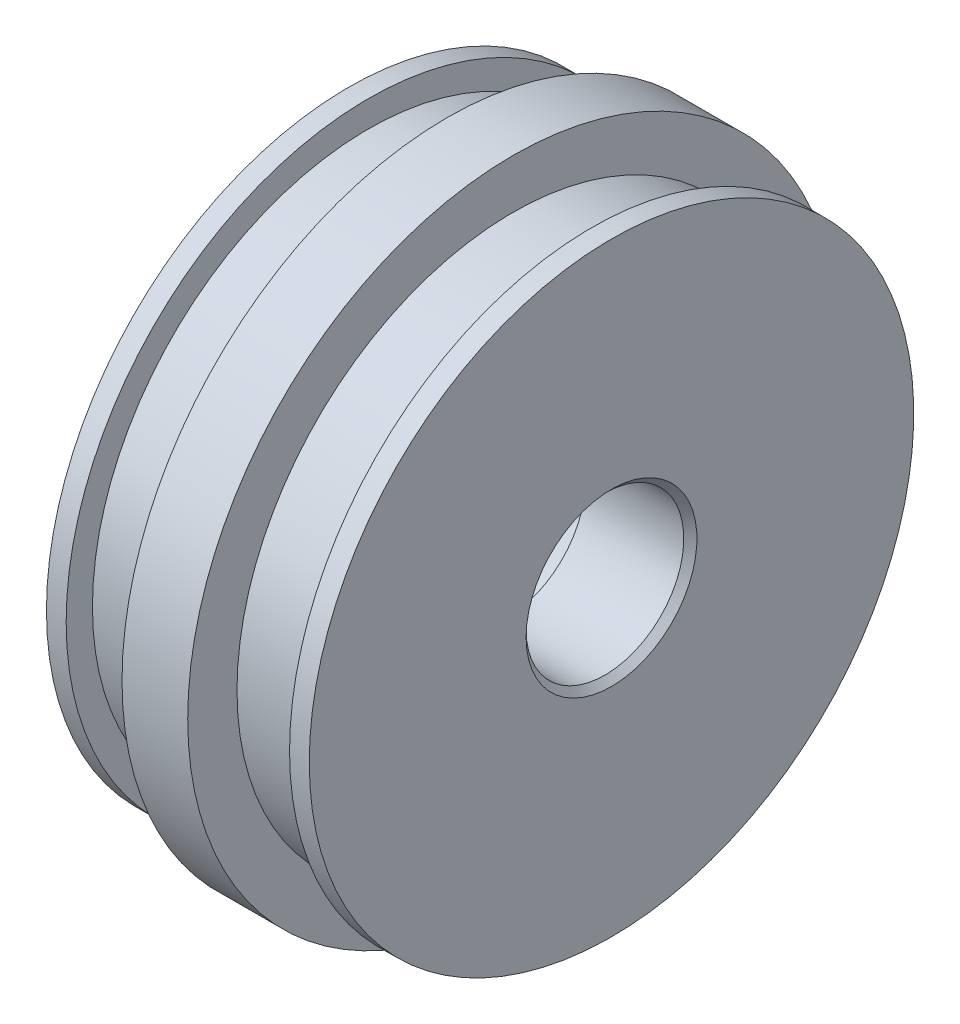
ISO-10303-21;
HEADER;
FILE_DESCRIPTION(('STEP AP214'),'2;1');
FILE_NAME('part.step','',(''),(''),'','','');
FILE_SCHEMA(('AUTOMOTIVE_DESIGN { 1 0 10303 214 1 1 1 1 }'));
ENDSEC;
DATA;
#1=APPLICATION_CONTEXT('core data for automotive mechanical design processes');
#2=APPLICATION_PROTOCOL_DEFINITION('international standard','automotive_design',2000,#1);
#3=PRODUCT_CONTEXT('',#1,'mechanical');
#4=PRODUCT('Part','Part','',(#3));
#5=PRODUCT_RELATED_PRODUCT_CATEGORY('part','',(#4));
#6=PRODUCT_DEFINITION_FORMATION('','',#4);
#7=PRODUCT_DEFINITION_CONTEXT('part definition',#1,'design');
#8=PRODUCT_DEFINITION('design','',#6,#7);
#9=PRODUCT_DEFINITION_SHAPE('','',#8);
#10=(LENGTH_UNIT() NAMED_UNIT(*) SI_UNIT(.MILLI.,.METRE.));
#11=(NAMED_UNIT(*) PLANE_ANGLE_UNIT() SI_UNIT($,.RADIAN.));
#12=(NAMED_UNIT(*) SI_UNIT($,.STERADIAN.) SOLID_ANGLE_UNIT());
#13=UNCERTAINTY_MEASURE_WITH_UNIT(LENGTH_MEASURE(1.E-05),#10,'distance_accuracy_value','');
#14=(GEOMETRIC_REPRESENTATION_CONTEXT(3) GLOBAL_UNCERTAINTY_ASSIGNED_CONTEXT((#13)) GLOBAL_UNIT_ASSIGNED_CONTEXT((#10,
#11,#12)) REPRESENTATION_CONTEXT('',''));
#15=CARTESIAN_POINT('',(0.,0.,0.));
#16=DIRECTION('',(0.,0.,1.));
#17=DIRECTION('',(1.,0.,0.));
#18=AXIS2_PLACEMENT_3D('',#15,#16,#17);
#19=CARTESIAN_POINT('',(0.,0.,0.));
#20=DIRECTION('',(-1.,0.,0.));
#21=DIRECTION('',(0.,0.,1.));
#22=AXIS2_PLACEMENT_3D('',#19,#20,#21);
#23=CYLINDRICAL_SURFACE('',#22,6.);
#24=CARTESIAN_POINT('',(19.5,0.,0.));
#25=DIRECTION('',(-1.,0.,0.));
#26=DIRECTION('',(0.,0.,1.));
#27=AXIS2_PLACEMENT_3D('',#24,#25,#26);
#28=CIRCLE('',#27,6.);
#29=CARTESIAN_POINT('',(19.5,0.,6.));
#30=VERTEX_POINT('',#29);
#31=EDGE_CURVE('E11',#30,#30,#28,.F.);
#32=ORIENTED_EDGE('',*,*,#31,.T.);
#33=EDGE_LOOP('',(#32));
#34=FACE_BOUND('',#33,.T.);
#35=CARTESIAN_POINT('',(12.,0.,0.));
#36=DIRECTION('',(-1.,0.,0.));
#37=DIRECTION('',(0.,0.,1.));
#38=AXIS2_PLACEMENT_3D('',#35,#36,#37);
#39=CIRCLE('',#38,6.);
#40=CARTESIAN_POINT('',(12.,0.,6.));
#41=VERTEX_POINT('',#40);
#42=EDGE_CURVE('E55',#41,#41,#39,.F.);
#43=ORIENTED_EDGE('',*,*,#42,.F.);
#44=EDGE_LOOP('',(#43));
#45=FACE_BOUND('',#44,.T.);
#46=ADVANCED_FACE('F37',(#34,#45),#23,.F.);
#47=CARTESIAN_POINT('',(0.,0.,0.));
#48=DIRECTION('',(-1.,0.,0.));
#49=DIRECTION('',(0.,0.,1.));
#50=AXIS2_PLACEMENT_3D('',#47,#48,#49);
#51=CYLINDRICAL_SURFACE('',#50,23.);
#52=CARTESIAN_POINT('',(0.,0.,0.));
#53=DIRECTION('',(-1.,0.,0.));
#54=DIRECTION('',(0.,0.,1.));
#55=AXIS2_PLACEMENT_3D('',#52,#53,#54);
#56=CIRCLE('',#55,23.);
#57=CARTESIAN_POINT('',(0.,0.,23.));
#58=VERTEX_POINT('',#57);
#59=EDGE_CURVE('E48',#58,#58,#56,.T.);
#60=ORIENTED_EDGE('',*,*,#59,.F.);
#61=EDGE_LOOP('',(#60));
#62=FACE_BOUND('',#61,.T.);
#63=CARTESIAN_POINT('',(1.5,0.,0.));
#64=DIRECTION('',(-1.,0.,0.));
#65=DIRECTION('',(0.,0.,1.));
#66=AXIS2_PLACEMENT_3D('',#63,#64,#65);
#67=CIRCLE('',#66,23.);
#68=CARTESIAN_POINT('',(1.5,0.,23.));
#69=VERTEX_POINT('',#68);
#70=EDGE_CURVE('E57',#69,#69,#67,.T.);
#71=ORIENTED_EDGE('',*,*,#70,.T.);
#72=EDGE_LOOP('',(#71));
#73=FACE_BOUND('',#72,.T.);
#74=ADVANCED_FACE('F39',(#62,#73),#51,.T.);
#75=CARTESIAN_POINT('',(0.,23.,0.));
#76=DIRECTION('',(1.,0.,0.));
#77=DIRECTION('',(0.,0.,-1.));
#78=AXIS2_PLACEMENT_3D('',#75,#76,#77);
#79=PLANE('',#78);
#80=CARTESIAN_POINT('',(0.,0.,0.));
#81=DIRECTION('',(-1.,0.,0.));
#82=DIRECTION('',(0.,0.,1.));
#83=AXIS2_PLACEMENT_3D('',#80,#81,#82);
#84=CIRCLE('',#83,16.);
#85=CARTESIAN_POINT('',(0.,0.,16.));
#86=VERTEX_POINT('',#85);
#87=EDGE_CURVE('E88',#86,#86,#84,.T.);
#88=ORIENTED_EDGE('',*,*,#87,.F.);
#89=EDGE_LOOP('',(#88));
#90=FACE_BOUND('',#89,.T.);
#91=ORIENTED_EDGE('',*,*,#59,.T.);
#92=EDGE_LOOP('',(#91));
#93=FACE_BOUND('',#92,.T.);
#94=ADVANCED_FACE('F94',(#90,#93),#79,.F.);
#95=CARTESIAN_POINT('',(20.,6.,0.));
#96=DIRECTION('',(-1.,0.,0.));
#97=DIRECTION('',(0.,0.,1.));
#98=AXIS2_PLACEMENT_3D('',#95,#96,#97);
#99=PLANE('',#98);
#100=CARTESIAN_POINT('',(20.,0.,0.));
#101=DIRECTION('',(-1.,0.,0.));
#102=DIRECTION('',(0.,0.,1.));
#103=AXIS2_PLACEMENT_3D('',#100,#101,#102);
#104=CIRCLE('',#103,6.5);
#105=CARTESIAN_POINT('',(20.,0.,6.5));
#106=VERTEX_POINT('',#105);
#107=EDGE_CURVE('E44',#106,#106,#104,.T.);
#108=ORIENTED_EDGE('',*,*,#107,.T.);
#109=EDGE_LOOP('',(#108));
#110=FACE_BOUND('',#109,.T.);
#111=CARTESIAN_POINT('',(20.,0.,0.));
#112=DIRECTION('',(-1.,0.,0.));
#113=DIRECTION('',(0.,0.,1.));
#114=AXIS2_PLACEMENT_3D('',#111,#112,#113);
#115=CIRCLE('',#114,23.);
#116=CARTESIAN_POINT('',(20.,0.,23.));
#117=VERTEX_POINT('',#116);
#118=EDGE_CURVE('E52',#117,#117,#115,.T.);
#119=ORIENTED_EDGE('',*,*,#118,.F.);
#120=EDGE_LOOP('',(#119));
#121=FACE_BOUND('',#120,.T.);
#122=ADVANCED_FACE('F97',(#110,#121),#99,.F.);
#123=CARTESIAN_POINT('',(0.,0.,0.));
#124=DIRECTION('',(-1.,0.,0.));
#125=DIRECTION('',(0.,0.,1.));
#126=AXIS2_PLACEMENT_3D('',#123,#124,#125);
#127=CYLINDRICAL_SURFACE('',#126,23.);
#128=CARTESIAN_POINT('',(18.5,0.,0.));
#129=DIRECTION('',(-1.,0.,0.));
#130=DIRECTION('',(0.,0.,1.));
#131=AXIS2_PLACEMENT_3D('',#128,#129,#130);
#132=CIRCLE('',#131,23.);
#133=CARTESIAN_POINT('',(18.5,0.,23.));
#134=VERTEX_POINT('',#133);
#135=EDGE_CURVE('E62',#134,#134,#132,.T.);
#136=ORIENTED_EDGE('',*,*,#135,.F.);
#137=EDGE_LOOP('',(#136));
#138=FACE_BOUND('',#137,.T.);
#139=ORIENTED_EDGE('',*,*,#118,.T.);
#140=EDGE_LOOP('',(#139));
#141=FACE_BOUND('',#140,.T.);
#142=ADVANCED_FACE('F144',(#138,#141),#127,.T.);
#143=CARTESIAN_POINT('',(18.5,23.,0.));
#144=DIRECTION('',(1.,0.,0.));
#145=DIRECTION('',(0.,0.,-1.));
#146=AXIS2_PLACEMENT_3D('',#143,#144,#145);
#147=PLANE('',#146);
#148=CARTESIAN_POINT('',(18.5,0.,0.));
#149=DIRECTION('',(-1.,0.,0.));
#150=DIRECTION('',(0.,0.,1.));
#151=AXIS2_PLACEMENT_3D('',#148,#149,#150);
#152=CIRCLE('',#151,21.);
#153=CARTESIAN_POINT('',(18.5,0.,21.));
#154=VERTEX_POINT('',#153);
#155=EDGE_CURVE('E65',#154,#154,#152,.T.);
#156=ORIENTED_EDGE('',*,*,#155,.F.);
#157=EDGE_LOOP('',(#156));
#158=FACE_BOUND('',#157,.T.);
#159=ORIENTED_EDGE('',*,*,#135,.T.);
#160=EDGE_LOOP('',(#159));
#161=FACE_BOUND('',#160,.T.);
#162=ADVANCED_FACE('F138',(#158,#161),#147,.F.);
#163=CARTESIAN_POINT('',(0.,0.,0.));
#164=DIRECTION('',(-1.,0.,0.));
#165=DIRECTION('',(0.,0.,1.));
#166=AXIS2_PLACEMENT_3D('',#163,#164,#165);
#167=CYLINDRICAL_SURFACE('',#166,21.);
#168=CARTESIAN_POINT('',(12.5,0.,0.));
#169=DIRECTION('',(-1.,0.,0.));
#170=DIRECTION('',(0.,0.,1.));
#171=AXIS2_PLACEMENT_3D('',#168,#169,#170);
#172=CIRCLE('',#171,21.);
#173=CARTESIAN_POINT('',(12.5,0.,21.));
#174=VERTEX_POINT('',#173);
#175=EDGE_CURVE('E68',#174,#174,#172,.T.);
#176=ORIENTED_EDGE('',*,*,#175,.F.);
#177=EDGE_LOOP('',(#176));
#178=FACE_BOUND('',#177,.T.);
#179=ORIENTED_EDGE('',*,*,#155,.T.);
#180=EDGE_LOOP('',(#179));
#181=FACE_BOUND('',#180,.T.);
#182=ADVANCED_FACE('F132',(#178,#181),#167,.T.);
#183=CARTESIAN_POINT('',(12.5,21.,0.));
#184=DIRECTION('',(-1.,0.,0.));
#185=DIRECTION('',(0.,0.,1.));
#186=AXIS2_PLACEMENT_3D('',#183,#184,#185);
#187=PLANE('',#186);
#188=CARTESIAN_POINT('',(12.5,0.,0.));
#189=DIRECTION('',(-1.,0.,0.));
#190=DIRECTION('',(0.,0.,1.));
#191=AXIS2_PLACEMENT_3D('',#188,#189,#190);
#192=CIRCLE('',#191,24.75);
#193=CARTESIAN_POINT('',(12.5,0.,24.75));
#194=VERTEX_POINT('',#193);
#195=EDGE_CURVE('E71',#194,#194,#192,.T.);
#196=ORIENTED_EDGE('',*,*,#195,.F.);
#197=EDGE_LOOP('',(#196));
#198=FACE_BOUND('',#197,.T.);
#199=ORIENTED_EDGE('',*,*,#175,.T.);
#200=EDGE_LOOP('',(#199));
#201=FACE_BOUND('',#200,.T.);
#202=ADVANCED_FACE('F126',(#198,#201),#187,.F.);
#203=CARTESIAN_POINT('',(0.,0.,0.));
#204=DIRECTION('',(-1.,0.,0.));
#205=DIRECTION('',(0.,0.,1.));
#206=AXIS2_PLACEMENT_3D('',#203,#204,#205);
#207=CYLINDRICAL_SURFACE('',#206,24.75);
#208=CARTESIAN_POINT('',(7.5,0.,0.));
#209=DIRECTION('',(-1.,0.,0.));
#210=DIRECTION('',(0.,0.,1.));
#211=AXIS2_PLACEMENT_3D('',#208,#209,#210);
#212=CIRCLE('',#211,24.75);
#213=CARTESIAN_POINT('',(7.5,0.,24.75));
#214=VERTEX_POINT('',#213);
#215=EDGE_CURVE('E74',#214,#214,#212,.T.);
#216=ORIENTED_EDGE('',*,*,#215,.F.);
#217=EDGE_LOOP('',(#216));
#218=FACE_BOUND('',#217,.T.);
#219=ORIENTED_EDGE('',*,*,#195,.T.);
#220=EDGE_LOOP('',(#219));
#221=FACE_BOUND('',#220,.T.);
#222=ADVANCED_FACE('F120',(#218,#221),#207,.T.);
#223=CARTESIAN_POINT('',(7.5,24.75,0.));
#224=DIRECTION('',(1.,0.,0.));
#225=DIRECTION('',(0.,0.,-1.));
#226=AXIS2_PLACEMENT_3D('',#223,#224,#225);
#227=PLANE('',#226);
#228=CARTESIAN_POINT('',(7.5,0.,0.));
#229=DIRECTION('',(-1.,0.,0.));
#230=DIRECTION('',(0.,0.,1.));
#231=AXIS2_PLACEMENT_3D('',#228,#229,#230);
#232=CIRCLE('',#231,21.);
#233=CARTESIAN_POINT('',(7.5,0.,21.));
#234=VERTEX_POINT('',#233);
#235=EDGE_CURVE('E77',#234,#234,#232,.T.);
#236=ORIENTED_EDGE('',*,*,#235,.F.);
#237=EDGE_LOOP('',(#236));
#238=FACE_BOUND('',#237,.T.);
#239=ORIENTED_EDGE('',*,*,#215,.T.);
#240=EDGE_LOOP('',(#239));
#241=FACE_BOUND('',#240,.T.);
#242=ADVANCED_FACE('F114',(#238,#241),#227,.F.);
#243=CARTESIAN_POINT('',(0.,0.,0.));
#244=DIRECTION('',(-1.,0.,0.));
#245=DIRECTION('',(0.,0.,1.));
#246=AXIS2_PLACEMENT_3D('',#243,#244,#245);
#247=CYLINDRICAL_SURFACE('',#246,21.);
#248=CARTESIAN_POINT('',(1.5,0.,0.));
#249=DIRECTION('',(-1.,0.,0.));
#250=DIRECTION('',(0.,0.,1.));
#251=AXIS2_PLACEMENT_3D('',#248,#249,#250);
#252=CIRCLE('',#251,21.);
#253=CARTESIAN_POINT('',(1.5,0.,21.));
#254=VERTEX_POINT('',#253);
#255=EDGE_CURVE('E80',#254,#254,#252,.T.);
#256=ORIENTED_EDGE('',*,*,#255,.F.);
#257=EDGE_LOOP('',(#256));
#258=FACE_BOUND('',#257,.T.);
#259=ORIENTED_EDGE('',*,*,#235,.T.);
#260=EDGE_LOOP('',(#259));
#261=FACE_BOUND('',#260,.T.);
#262=ADVANCED_FACE('F108',(#258,#261),#247,.T.);
#263=CARTESIAN_POINT('',(1.5,21.,0.));
#264=DIRECTION('',(-1.,0.,0.));
#265=DIRECTION('',(0.,0.,1.));
#266=AXIS2_PLACEMENT_3D('',#263,#264,#265);
#267=PLANE('',#266);
#268=ORIENTED_EDGE('',*,*,#70,.F.);
#269=EDGE_LOOP('',(#268));
#270=FACE_BOUND('',#269,.T.);
#271=ORIENTED_EDGE('',*,*,#255,.T.);
#272=EDGE_LOOP('',(#271));
#273=FACE_BOUND('',#272,.T.);
#274=ADVANCED_FACE('F104',(#270,#273),#267,.F.);
#275=CARTESIAN_POINT('',(12.,0.,0.));
#276=DIRECTION('',(-1.,0.,0.));
#277=DIRECTION('',(0.,0.,1.));
#278=AXIS2_PLACEMENT_3D('',#275,#276,#277);
#279=PLANE('',#278);
#280=CARTESIAN_POINT('',(12.,0.,0.));
#281=DIRECTION('',(-1.,0.,0.));
#282=DIRECTION('',(0.,0.,1.));
#283=AXIS2_PLACEMENT_3D('',#280,#281,#282);
#284=CIRCLE('',#283,16.);
#285=CARTESIAN_POINT('',(12.,0.,16.));
#286=VERTEX_POINT('',#285);
#287=EDGE_CURVE('E58',#286,#286,#284,.T.);
#288=ORIENTED_EDGE('',*,*,#287,.T.);
#289=EDGE_LOOP('',(#288));
#290=FACE_BOUND('',#289,.T.);
#291=ORIENTED_EDGE('',*,*,#42,.T.);
#292=EDGE_LOOP('',(#291));
#293=FACE_BOUND('',#292,.T.);
#294=ADVANCED_FACE('F107',(#290,#293),#279,.T.);
#295=CARTESIAN_POINT('',(12.,0.,0.));
#296=DIRECTION('',(-1.,0.,0.));
#297=DIRECTION('',(0.,0.,1.));
#298=AXIS2_PLACEMENT_3D('',#295,#296,#297);
#299=CYLINDRICAL_SURFACE('',#298,16.);
#300=ORIENTED_EDGE('',*,*,#287,.F.);
#301=EDGE_LOOP('',(#300));
#302=FACE_BOUND('',#301,.T.);
#303=ORIENTED_EDGE('',*,*,#87,.T.);
#304=EDGE_LOOP('',(#303));
#305=FACE_BOUND('',#304,.T.);
#306=ADVANCED_FACE('F92',(#302,#305),#299,.F.);
#307=CARTESIAN_POINT('',(20.,0.,0.));
#308=DIRECTION('',(1.,0.,0.));
#309=DIRECTION('',(0.,0.,-1.));
#310=AXIS2_PLACEMENT_3D('',#307,#308,#309);
#311=CONICAL_SURFACE('',#310,6.5,0.785398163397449);
#312=ORIENTED_EDGE('',*,*,#31,.F.);
#313=EDGE_LOOP('',(#312));
#314=FACE_BOUND('',#313,.T.);
#315=ORIENTED_EDGE('',*,*,#107,.F.);
#316=EDGE_LOOP('',(#315));
#317=FACE_BOUND('',#316,.T.);
#318=ADVANCED_FACE('F170',(#314,#317),#311,.F.);
#319=CLOSED_SHELL('',(#46,#74,#94,#122,#142,#162,#182,#202,#222,#242,#262,#274,#294,#306,#318));
#320=MANIFOLD_SOLID_BREP('B2',#319);
#321=ADVANCED_BREP_SHAPE_REPRESENTATION('',(#18,#320),#14);
#322=SHAPE_DEFINITION_REPRESENTATION(#9,#321);
ENDSEC;
END-ISO-10303-21;
